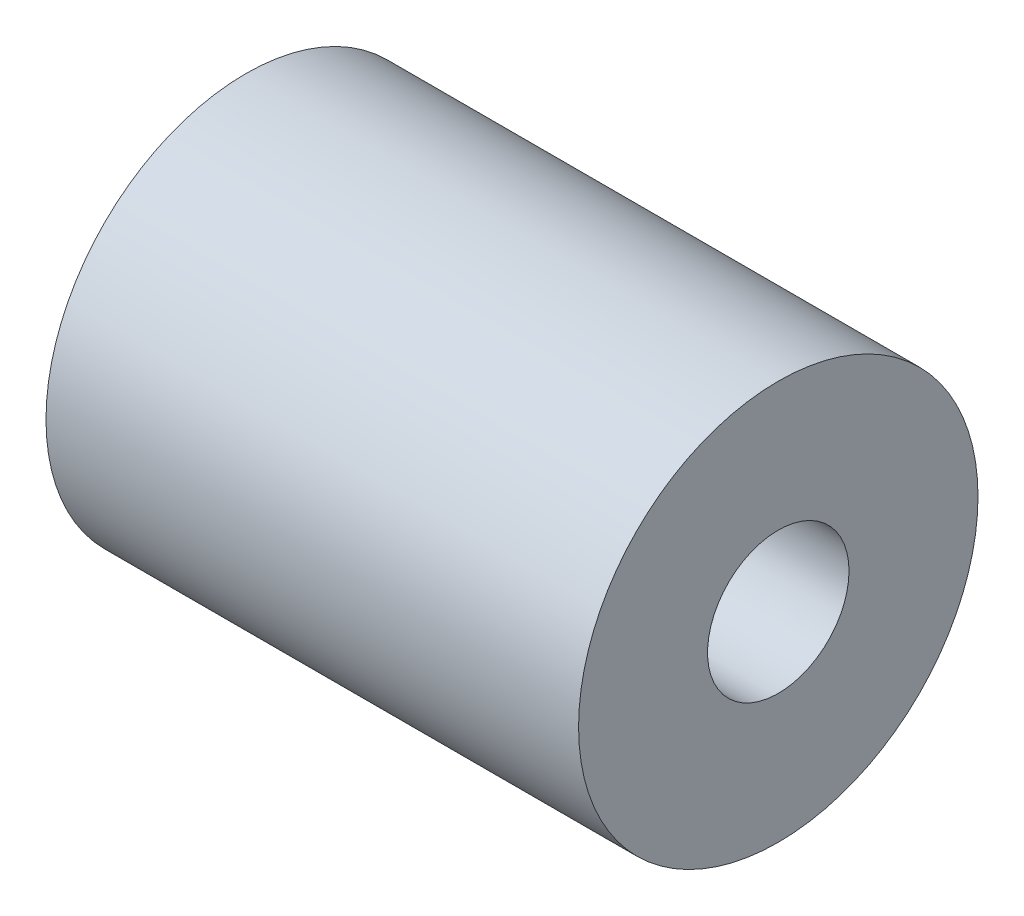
from build123d import *

# Parameters (mm, degrees)
SKETCH1_R      = 9.525
SKETCH1_R_2    = 3.37312
EXTRUDE1_DEPTH = 25.4


with BuildPart() as part:
    # Sketch1 → Extrude1 (new body)
    with BuildSketch(Plane(origin=(0, 0, 0), x_dir=(0, 0, -1), z_dir=(1, 0, 0))):
        Circle(SKETCH1_R)
        Circle(SKETCH1_R_2, mode=Mode.SUBTRACT)
    extrude(amount=EXTRUDE1_DEPTH)


solid = part.part
